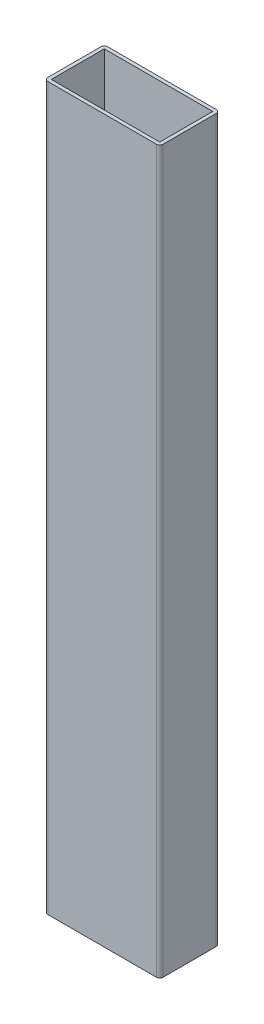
from build123d import *

# Parameters (mm, degrees)
SKETCH1_W           = 49.657
SKETCH1_H           = 24.257
EXTRUDE_THIN1_DEPTH = 165.1


with BuildPart() as part:
    # Sketch1 → Extrude-Thin1 (new, symmetric)
    with BuildSketch(Plane(origin=(0, 0, 0), x_dir=(1, 0, 0), z_dir=(0, 1, 0))):
        with BuildLine():
            Line((-26.416, 12.1285), (-26.416, -12.1285))
            ThreePointArc((-26.416, -12.1285), (-25.951032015, -13.251032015), (-24.8285, -13.716))
            Line((-24.8285, -13.716), (24.8285, -13.716))
            ThreePointArc((24.8285, -13.716), (25.951032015, -13.251032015), (26.416, -12.1285))
            Line((26.416, -12.1285), (26.416, 12.1285))
            ThreePointArc((26.416, 12.1285), (25.951032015, 13.251032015), (24.8285, 13.716))
            Line((24.8285, 13.716), (-24.8285, 13.716))
            ThreePointArc((-24.8285, 13.716), (-25.951032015, 13.251032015), (-26.416, 12.1285))
        make_face()
        Rectangle(SKETCH1_W, SKETCH1_H, mode=Mode.SUBTRACT)
    extrude(amount=EXTRUDE_THIN1_DEPTH, both=True)


solid = part.part
